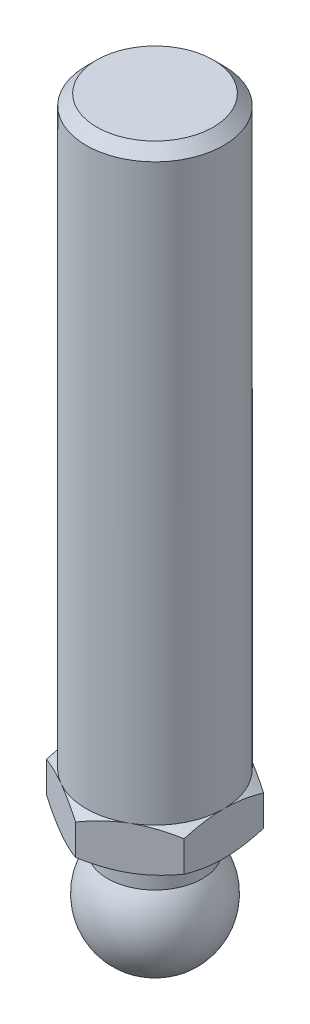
ISO-10303-21;
HEADER;
FILE_DESCRIPTION(('STEP AP214'),'2;1');
FILE_NAME('part.step','',(''),(''),'','','');
FILE_SCHEMA(('AUTOMOTIVE_DESIGN { 1 0 10303 214 1 1 1 1 }'));
ENDSEC;
DATA;
#1=APPLICATION_CONTEXT('core data for automotive mechanical design processes');
#2=APPLICATION_PROTOCOL_DEFINITION('international standard','automotive_design',2000,#1);
#3=PRODUCT_CONTEXT('',#1,'mechanical');
#4=PRODUCT('Part','Part','',(#3));
#5=PRODUCT_RELATED_PRODUCT_CATEGORY('part','',(#4));
#6=PRODUCT_DEFINITION_FORMATION('','',#4);
#7=PRODUCT_DEFINITION_CONTEXT('part definition',#1,'design');
#8=PRODUCT_DEFINITION('design','',#6,#7);
#9=PRODUCT_DEFINITION_SHAPE('','',#8);
#10=(LENGTH_UNIT() NAMED_UNIT(*) SI_UNIT(.MILLI.,.METRE.));
#11=(NAMED_UNIT(*) PLANE_ANGLE_UNIT() SI_UNIT($,.RADIAN.));
#12=(NAMED_UNIT(*) SI_UNIT($,.STERADIAN.) SOLID_ANGLE_UNIT());
#13=UNCERTAINTY_MEASURE_WITH_UNIT(LENGTH_MEASURE(1.E-05),#10,'distance_accuracy_value','');
#14=(GEOMETRIC_REPRESENTATION_CONTEXT(3) GLOBAL_UNCERTAINTY_ASSIGNED_CONTEXT((#13)) GLOBAL_UNIT_ASSIGNED_CONTEXT((#10,
#11,#12)) REPRESENTATION_CONTEXT('',''));
#15=CARTESIAN_POINT('',(0.,0.,0.));
#16=DIRECTION('',(0.,0.,1.));
#17=DIRECTION('',(1.,0.,0.));
#18=AXIS2_PLACEMENT_3D('',#15,#16,#17);
#19=CARTESIAN_POINT('',(0.,19.5,0.));
#20=DIRECTION('',(0.,-1.,0.));
#21=DIRECTION('',(0.,0.,-1.));
#22=AXIS2_PLACEMENT_3D('',#19,#20,#21);
#23=CONICAL_SURFACE('',#22,8.,1.0471975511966);
#24=CARTESIAN_POINT('',(-8.,14.714451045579,14.1889203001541));
#25=CARTESIAN_POINT('',(-8.,14.8842783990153,13.851186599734));
#26=CARTESIAN_POINT('',(-8.,15.0529801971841,13.5128811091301));
#27=CARTESIAN_POINT('',(-8.,15.3875863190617,12.8348638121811));
#28=CARTESIAN_POINT('',(-8.,15.553490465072,12.4951519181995));
#29=CARTESIAN_POINT('',(-8.,15.8822522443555,11.8134403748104));
#30=CARTESIAN_POINT('',(-8.,16.0451033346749,11.4714375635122));
#31=CARTESIAN_POINT('',(-8.,16.3666666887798,10.7854960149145));
#32=CARTESIAN_POINT('',(-8.,16.5253790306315,10.4415573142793));
#33=CARTESIAN_POINT('',(-8.,16.8449502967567,9.73535271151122));
#34=CARTESIAN_POINT('',(-8.,17.0055671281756,9.37297690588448));
#35=CARTESIAN_POINT('',(-8.,17.3197730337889,8.64516064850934));
#36=CARTESIAN_POINT('',(-8.,17.4733617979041,8.27972006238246));
#37=CARTESIAN_POINT('',(-8.,17.7714937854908,7.54540420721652));
#38=CARTESIAN_POINT('',(-8.,17.9160424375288,7.1765311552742));
#39=CARTESIAN_POINT('',(-8.,18.1936308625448,6.43449862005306));
#40=CARTESIAN_POINT('',(-8.,18.3266718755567,6.06133960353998));
#41=CARTESIAN_POINT('',(-8.,18.605819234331,5.22677195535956));
#42=CARTESIAN_POINT('',(-8.,18.7482891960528,4.76412920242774));
#43=CARTESIAN_POINT('',(-8.,19.0033463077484,3.83044032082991));
#44=CARTESIAN_POINT('',(-8.,19.115935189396,3.3593946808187));
#45=CARTESIAN_POINT('',(-8.,19.2546281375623,2.651184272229));
#46=CARTESIAN_POINT('',(-8.,19.2955954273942,2.41690742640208));
#47=CARTESIAN_POINT('',(-8.,19.3670123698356,1.94676929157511));
#48=CARTESIAN_POINT('',(-8.,19.3974635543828,1.71090823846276));
#49=CARTESIAN_POINT('',(-8.,19.4469446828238,1.23805721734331));
#50=CARTESIAN_POINT('',(-8.,19.4659782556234,1.0010676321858));
#51=CARTESIAN_POINT('',(-8.,19.4920206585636,0.526423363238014));
#52=CARTESIAN_POINT('',(-8.,19.499029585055,0.288768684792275));
#53=CARTESIAN_POINT('',(-8.,19.5007883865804,-0.188309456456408));
#54=CARTESIAN_POINT('',(-8.,19.4954490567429,-0.427733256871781));
#55=CARTESIAN_POINT('',(-8.,19.4725128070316,-0.905988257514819));
#56=CARTESIAN_POINT('',(-8.,19.4549157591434,-1.14481945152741));
#57=CARTESIAN_POINT('',(-8.,19.4080408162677,-1.62141631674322));
#58=CARTESIAN_POINT('',(-8.,19.3787584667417,-1.85918154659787));
#59=CARTESIAN_POINT('',(-8.,19.3094074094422,-2.33311174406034));
#60=CARTESIAN_POINT('',(-8.,19.2693385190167,-2.56927668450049));
#61=CARTESIAN_POINT('',(-8.,19.1329562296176,-3.28330816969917));
#62=CARTESIAN_POINT('',(-8.,19.0213579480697,-3.75830022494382));
#63=CARTESIAN_POINT('',(-8.,18.830875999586,-4.46428489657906));
#64=CARTESIAN_POINT('',(-8.,18.7635265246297,-4.69855285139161));
#65=CARTESIAN_POINT('',(-8.,18.6221775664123,-5.16507806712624));
#66=CARTESIAN_POINT('',(-8.,18.5481783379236,-5.39733540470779));
#67=CARTESIAN_POINT('',(-8.,18.3456232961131,-6.00705809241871));
#68=CARTESIAN_POINT('',(-8.,18.2123002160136,-6.38293491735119));
#69=CARTESIAN_POINT('',(-8.,17.9338794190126,-7.13030495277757));
#70=CARTESIAN_POINT('',(-8.,17.7887803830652,-7.50179766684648));
#71=CARTESIAN_POINT('',(-8.,17.4893388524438,-8.24128843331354));
#72=CARTESIAN_POINT('',(-8.,17.3349906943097,-8.60928418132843));
#73=CARTESIAN_POINT('',(-8.,17.0191219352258,-9.34215095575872));
#74=CARTESIAN_POINT('',(-8.,16.8576016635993,-9.70702212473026));
#75=CARTESIAN_POINT('',(-8.,16.5362228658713,-10.4179250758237));
#76=CARTESIAN_POINT('',(-8.,16.3766130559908,-10.7640696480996));
#77=CARTESIAN_POINT('',(-8.,16.0531867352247,-11.4543922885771));
#78=CARTESIAN_POINT('',(-8.,15.8893701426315,-11.798570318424));
#79=CARTESIAN_POINT('',(-8.,15.558638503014,-12.4845836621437));
#80=CARTESIAN_POINT('',(-8.,15.3917303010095,-12.8264222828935));
#81=CARTESIAN_POINT('',(-8.,15.0550779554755,-13.5086735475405));
#82=CARTESIAN_POINT('',(-8.,14.8853339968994,-13.8490862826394));
#83=CARTESIAN_POINT('',(-8.,14.714451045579,-14.1889203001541));
#84=B_SPLINE_CURVE_WITH_KNOTS('',3,(#24,#25,#26,#27,#28,#29,#30,#31,#32,#33,#34,#35,#36,#37,#38,
#39,#40,#41,#42,#43,#44,#45,#46,#47,#48,#49,#50,#51,#52,#53,#54,#55,#56,#57,#58,#59,#60,#61,#62,
#63,#64,#65,#66,#67,#68,#69,#70,#71,#72,#73,#74,#75,#76,#77,#78,#79,#80,#81,#82,#83),
.UNSPECIFIED.,.F.,.F.,(4,2,2,2,2,2,2,2,2,2,2,2,2,2,2,2,2,2,2,2,2,2,2,2,2,2,2,2,2,4),(0.,
1.13409047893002,2.26825272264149,3.40461779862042,4.5409614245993,5.73003075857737,
6.91915250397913,8.10755318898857,9.29582565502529,10.7473798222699,12.1988498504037,
12.9121466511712,13.6253394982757,14.3383055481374,15.0512658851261,15.7693927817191,
16.487527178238,17.2059355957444,17.9243561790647,19.38648697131,20.1177019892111,
20.8488890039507,22.0450800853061,23.2414053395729,24.4384707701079,25.6354812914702,
26.7789606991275,27.9224623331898,29.063679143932,30.2048218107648),.UNSPECIFIED.);
#85=CARTESIAN_POINT('',(-8.,18.7854688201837,4.61880215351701));
#86=VERTEX_POINT('',#85);
#87=CARTESIAN_POINT('',(-8.,19.5,0.));
#88=VERTEX_POINT('',#87);
#89=EDGE_CURVE('E313',#86,#88,#84,.T.);
#90=ORIENTED_EDGE('',*,*,#89,.F.);
#91=CARTESIAN_POINT('',(0.0002,18.7854021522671,9.23771977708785));
#92=CARTESIAN_POINT('',(-0.175648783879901,18.8440092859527,9.13619343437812));
#93=CARTESIAN_POINT('',(-0.352153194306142,18.8999565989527,9.03428856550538));
#94=CARTESIAN_POINT('',(-0.706595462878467,19.0057989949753,8.82965122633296));
#95=CARTESIAN_POINT('',(-0.884533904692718,19.0556914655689,8.72691841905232));
#96=CARTESIAN_POINT('',(-1.42119823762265,19.1953072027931,8.41707512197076));
#97=CARTESIAN_POINT('',(-1.78204258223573,19.2747188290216,8.20874154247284));
#98=CARTESIAN_POINT('',(-2.32203917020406,19.3678383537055,7.89697436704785));
#99=CARTESIAN_POINT('',(-2.49957818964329,19.3943654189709,7.79447216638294));
#100=CARTESIAN_POINT('',(-2.85545911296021,19.4388468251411,7.58900421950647));
#101=CARTESIAN_POINT('',(-3.03380094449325,19.4568019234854,7.4860385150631));
#102=CARTESIAN_POINT('',(-3.3907916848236,19.4836843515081,7.27992981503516));
#103=CARTESIAN_POINT('',(-3.56944001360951,19.4926219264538,7.17678715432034));
#104=CARTESIAN_POINT('',(-3.92690170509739,19.5012776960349,6.97040655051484));
#105=CARTESIAN_POINT('',(-4.10571506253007,19.5009961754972,6.86716861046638));
#106=CARTESIAN_POINT('',(-4.44001336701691,19.4918549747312,6.67416139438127));
#107=CARTESIAN_POINT('',(-4.59552190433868,19.4841103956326,6.58437849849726));
#108=CARTESIAN_POINT('',(-4.90617476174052,19.4617988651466,6.40502298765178));
#109=CARTESIAN_POINT('',(-5.06131905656,19.4472314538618,6.31545038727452));
#110=CARTESIAN_POINT('',(-5.52615131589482,19.3936393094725,6.04707935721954));
#111=CARTESIAN_POINT('',(-5.83501648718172,19.3447313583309,5.86875596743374));
#112=CARTESIAN_POINT('',(-6.4560232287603,19.2224605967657,5.51021755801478));
#113=CARTESIAN_POINT('',(-6.76808554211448,19.148579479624,5.33004829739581));
#114=CARTESIAN_POINT('',(-7.38755648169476,18.980899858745,4.97239658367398));
#115=CARTESIAN_POINT('',(-7.69497304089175,18.8871407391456,4.79490955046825));
#116=CARTESIAN_POINT('',(-8.0002,18.7854021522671,4.61868668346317));
#117=B_SPLINE_CURVE_WITH_KNOTS('',3,(#91,#92,#93,#94,#95,#96,#97,#98,#99,#100,#101,#102,#103,
#104,#105,#106,#107,#108,#109,#110,#111,#112,#113,#114,#115,#116),.UNSPECIFIED.,.F.,.F.,(4,2,2,
2,2,2,2,2,2,2,2,2,4),(0.,0.633973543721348,1.26821965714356,2.53934712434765,3.15934343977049,
3.77928496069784,4.39852133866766,5.01773858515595,5.55680239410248,6.09590254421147,
7.17487077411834,8.27776850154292,9.37850115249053),.UNSPECIFIED.);
#118=CARTESIAN_POINT('',(-4.,19.5,6.92820323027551));
#119=VERTEX_POINT('',#118);
#120=EDGE_CURVE('E138',#119,#86,#117,.T.);
#121=ORIENTED_EDGE('',*,*,#120,.F.);
#122=CARTESIAN_POINT('',(0.,19.5,0.));
#123=DIRECTION('',(0.,-1.,0.));
#124=DIRECTION('',(0.,0.,-1.));
#125=AXIS2_PLACEMENT_3D('',#122,#123,#124);
#126=CIRCLE('',#125,8.);
#127=EDGE_CURVE('E286',#119,#88,#126,.T.);
#128=ORIENTED_EDGE('',*,*,#127,.T.);
#129=EDGE_LOOP('',(#90,#121,#128));
#130=FACE_BOUND('',#129,.T.);
#131=ADVANCED_FACE('F17',(#130),#23,.T.);
#132=CARTESIAN_POINT('',(-8.,18.7854688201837,-4.61880215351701));
#133=VERTEX_POINT('',#132);
#134=EDGE_CURVE('E196',#88,#133,#84,.T.);
#135=ORIENTED_EDGE('',*,*,#134,.F.);
#136=CARTESIAN_POINT('',(-4.,19.5,-6.92820323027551));
#137=VERTEX_POINT('',#136);
#138=EDGE_CURVE('E198',#88,#137,#126,.T.);
#139=ORIENTED_EDGE('',*,*,#138,.T.);
#140=CARTESIAN_POINT('',(-8.0002,18.7854021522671,-4.61868668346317));
#141=CARTESIAN_POINT('',(-7.8243512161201,18.8440092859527,-4.7202130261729));
#142=CARTESIAN_POINT('',(-7.64784680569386,18.8999565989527,-4.82211789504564));
#143=CARTESIAN_POINT('',(-7.29340453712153,19.0057989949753,-5.02675523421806));
#144=CARTESIAN_POINT('',(-7.11546609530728,19.0556914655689,-5.1294880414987));
#145=CARTESIAN_POINT('',(-6.57880176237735,19.1953072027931,-5.43933133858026));
#146=CARTESIAN_POINT('',(-6.21795741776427,19.2747188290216,-5.64766491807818));
#147=CARTESIAN_POINT('',(-5.67796082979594,19.3678383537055,-5.95943209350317));
#148=CARTESIAN_POINT('',(-5.50042181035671,19.3943654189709,-6.06193429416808));
#149=CARTESIAN_POINT('',(-5.14454088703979,19.4388468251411,-6.26740224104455));
#150=CARTESIAN_POINT('',(-4.96619905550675,19.4568019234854,-6.37036794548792));
#151=CARTESIAN_POINT('',(-4.6092083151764,19.4836843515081,-6.57647664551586));
#152=CARTESIAN_POINT('',(-4.43055998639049,19.4926219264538,-6.67961930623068));
#153=CARTESIAN_POINT('',(-4.07309829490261,19.5012776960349,-6.88599991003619));
#154=CARTESIAN_POINT('',(-3.89428493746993,19.5009961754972,-6.98923785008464));
#155=CARTESIAN_POINT('',(-3.55998663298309,19.4918549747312,-7.18224506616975));
#156=CARTESIAN_POINT('',(-3.40447809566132,19.4841103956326,-7.27202796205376));
#157=CARTESIAN_POINT('',(-3.09382523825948,19.4617988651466,-7.45138347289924));
#158=CARTESIAN_POINT('',(-2.93868094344,19.4472314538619,-7.54095607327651));
#159=CARTESIAN_POINT('',(-2.47384868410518,19.3936393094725,-7.80932710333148));
#160=CARTESIAN_POINT('',(-2.16498351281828,19.3447313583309,-7.98765049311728));
#161=CARTESIAN_POINT('',(-1.5439767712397,19.2224605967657,-8.34618890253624));
#162=CARTESIAN_POINT('',(-1.23191445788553,19.148579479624,-8.52635816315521));
#163=CARTESIAN_POINT('',(-0.612443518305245,18.980899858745,-8.88400987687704));
#164=CARTESIAN_POINT('',(-0.305026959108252,18.8871407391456,-9.06149691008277));
#165=CARTESIAN_POINT('',(0.000199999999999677,18.7854021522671,-9.23771977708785));
#166=B_SPLINE_CURVE_WITH_KNOTS('',3,(#140,#141,#142,#143,#144,#145,#146,#147,#148,#149,#150,
#151,#152,#153,#154,#155,#156,#157,#158,#159,#160,#161,#162,#163,#164,#165),.UNSPECIFIED.,.F.,
.F.,(4,2,2,2,2,2,2,2,2,2,2,2,4),(0.,0.633973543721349,1.26821965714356,2.53934712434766,
3.15934343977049,3.77928496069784,4.39852133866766,5.01773858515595,5.55680239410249,
6.09590254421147,7.17487077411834,8.27776850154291,9.37850115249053),.UNSPECIFIED.);
#167=EDGE_CURVE('E186',#133,#137,#166,.T.);
#168=ORIENTED_EDGE('',*,*,#167,.F.);
#169=EDGE_LOOP('',(#135,#139,#168));
#170=FACE_BOUND('',#169,.T.);
#171=ADVANCED_FACE('F195',(#170),#23,.T.);
#172=CARTESIAN_POINT('',(0.,18.7854688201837,-9.23760430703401));
#173=VERTEX_POINT('',#172);
#174=EDGE_CURVE('E200',#137,#173,#166,.T.);
#175=ORIENTED_EDGE('',*,*,#174,.F.);
#176=CARTESIAN_POINT('',(4.,19.5,-6.92820323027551));
#177=VERTEX_POINT('',#176);
#178=EDGE_CURVE('E293',#137,#177,#126,.T.);
#179=ORIENTED_EDGE('',*,*,#178,.T.);
#180=CARTESIAN_POINT('',(-0.0002,18.7854021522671,-9.23771977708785));
#181=CARTESIAN_POINT('',(0.175648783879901,18.8440092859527,-9.13619343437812));
#182=CARTESIAN_POINT('',(0.352153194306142,18.8999565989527,-9.03428856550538));
#183=CARTESIAN_POINT('',(0.706595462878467,19.0057989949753,-8.82965122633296));
#184=CARTESIAN_POINT('',(0.884533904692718,19.0556914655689,-8.72691841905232));
#185=CARTESIAN_POINT('',(1.42119823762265,19.1953072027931,-8.41707512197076));
#186=CARTESIAN_POINT('',(1.78204258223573,19.2747188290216,-8.20874154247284));
#187=CARTESIAN_POINT('',(2.32203917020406,19.3678383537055,-7.89697436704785));
#188=CARTESIAN_POINT('',(2.49957818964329,19.3943654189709,-7.79447216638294));
#189=CARTESIAN_POINT('',(2.85545911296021,19.4388468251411,-7.58900421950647));
#190=CARTESIAN_POINT('',(3.03380094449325,19.4568019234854,-7.4860385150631));
#191=CARTESIAN_POINT('',(3.3907916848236,19.4836843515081,-7.27992981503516));
#192=CARTESIAN_POINT('',(3.56944001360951,19.4926219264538,-7.17678715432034));
#193=CARTESIAN_POINT('',(3.92690170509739,19.5012776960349,-6.97040655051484));
#194=CARTESIAN_POINT('',(4.10571506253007,19.5009961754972,-6.86716861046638));
#195=CARTESIAN_POINT('',(4.44001336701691,19.4918549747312,-6.67416139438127));
#196=CARTESIAN_POINT('',(4.59552190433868,19.4841103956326,-6.58437849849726));
#197=CARTESIAN_POINT('',(4.90617476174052,19.4617988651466,-6.40502298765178));
#198=CARTESIAN_POINT('',(5.06131905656,19.4472314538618,-6.31545038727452));
#199=CARTESIAN_POINT('',(5.52615131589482,19.3936393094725,-6.04707935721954));
#200=CARTESIAN_POINT('',(5.83501648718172,19.3447313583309,-5.86875596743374));
#201=CARTESIAN_POINT('',(6.4560232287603,19.2224605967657,-5.51021755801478));
#202=CARTESIAN_POINT('',(6.76808554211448,19.148579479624,-5.33004829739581));
#203=CARTESIAN_POINT('',(7.38755648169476,18.980899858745,-4.97239658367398));
#204=CARTESIAN_POINT('',(7.69497304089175,18.8871407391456,-4.79490955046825));
#205=CARTESIAN_POINT('',(8.0002,18.7854021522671,-4.61868668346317));
#206=B_SPLINE_CURVE_WITH_KNOTS('',3,(#180,#181,#182,#183,#184,#185,#186,#187,#188,#189,#190,
#191,#192,#193,#194,#195,#196,#197,#198,#199,#200,#201,#202,#203,#204,#205),.UNSPECIFIED.,.F.,
.F.,(4,2,2,2,2,2,2,2,2,2,2,2,4),(0.,0.633973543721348,1.26821965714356,2.53934712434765,
3.15934343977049,3.77928496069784,4.39852133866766,5.01773858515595,5.55680239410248,
6.09590254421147,7.17487077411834,8.27776850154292,9.37850115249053),.UNSPECIFIED.);
#207=EDGE_CURVE('E246',#173,#177,#206,.T.);
#208=ORIENTED_EDGE('',*,*,#207,.F.);
#209=EDGE_LOOP('',(#175,#179,#208));
#210=FACE_BOUND('',#209,.T.);
#211=ADVANCED_FACE('F345',(#210),#23,.T.);
#212=CARTESIAN_POINT('',(8.,18.7854688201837,-4.61880215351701));
#213=VERTEX_POINT('',#212);
#214=EDGE_CURVE('E241',#177,#213,#206,.T.);
#215=ORIENTED_EDGE('',*,*,#214,.F.);
#216=CARTESIAN_POINT('',(8.,19.5,0.));
#217=VERTEX_POINT('',#216);
#218=EDGE_CURVE('E290',#177,#217,#126,.T.);
#219=ORIENTED_EDGE('',*,*,#218,.T.);
#220=CARTESIAN_POINT('',(8.,14.714451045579,-14.1889203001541));
#221=CARTESIAN_POINT('',(8.,14.8842783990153,-13.851186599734));
#222=CARTESIAN_POINT('',(8.,15.0529801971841,-13.5128811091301));
#223=CARTESIAN_POINT('',(8.,15.3875863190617,-12.8348638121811));
#224=CARTESIAN_POINT('',(8.,15.553490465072,-12.4951519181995));
#225=CARTESIAN_POINT('',(8.,15.8822522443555,-11.8134403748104));
#226=CARTESIAN_POINT('',(8.,16.0451033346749,-11.4714375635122));
#227=CARTESIAN_POINT('',(8.,16.3666666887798,-10.7854960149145));
#228=CARTESIAN_POINT('',(8.,16.5253790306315,-10.4415573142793));
#229=CARTESIAN_POINT('',(8.,16.8449502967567,-9.73535271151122));
#230=CARTESIAN_POINT('',(8.,17.0055671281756,-9.37297690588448));
#231=CARTESIAN_POINT('',(8.,17.3197730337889,-8.64516064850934));
#232=CARTESIAN_POINT('',(8.,17.4733617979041,-8.27972006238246));
#233=CARTESIAN_POINT('',(8.,17.7714937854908,-7.54540420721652));
#234=CARTESIAN_POINT('',(8.,17.9160424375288,-7.1765311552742));
#235=CARTESIAN_POINT('',(8.,18.1936308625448,-6.43449862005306));
#236=CARTESIAN_POINT('',(8.,18.3266718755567,-6.06133960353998));
#237=CARTESIAN_POINT('',(8.,18.605819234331,-5.22677195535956));
#238=CARTESIAN_POINT('',(8.,18.7482891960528,-4.76412920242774));
#239=CARTESIAN_POINT('',(8.,19.0033463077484,-3.83044032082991));
#240=CARTESIAN_POINT('',(8.,19.115935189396,-3.3593946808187));
#241=CARTESIAN_POINT('',(8.,19.2546281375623,-2.651184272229));
#242=CARTESIAN_POINT('',(8.,19.2955954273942,-2.41690742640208));
#243=CARTESIAN_POINT('',(8.,19.3670123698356,-1.94676929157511));
#244=CARTESIAN_POINT('',(8.,19.3974635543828,-1.71090823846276));
#245=CARTESIAN_POINT('',(8.,19.4469446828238,-1.23805721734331));
#246=CARTESIAN_POINT('',(8.,19.4659782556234,-1.0010676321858));
#247=CARTESIAN_POINT('',(8.,19.4920206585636,-0.526423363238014));
#248=CARTESIAN_POINT('',(8.,19.499029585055,-0.288768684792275));
#249=CARTESIAN_POINT('',(8.,19.5007883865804,0.188309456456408));
#250=CARTESIAN_POINT('',(8.,19.4954490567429,0.427733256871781));
#251=CARTESIAN_POINT('',(8.,19.4725128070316,0.905988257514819));
#252=CARTESIAN_POINT('',(8.,19.4549157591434,1.14481945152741));
#253=CARTESIAN_POINT('',(8.,19.4080408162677,1.62141631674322));
#254=CARTESIAN_POINT('',(8.,19.3787584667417,1.85918154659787));
#255=CARTESIAN_POINT('',(8.,19.3094074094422,2.33311174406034));
#256=CARTESIAN_POINT('',(8.,19.2693385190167,2.56927668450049));
#257=CARTESIAN_POINT('',(8.,19.1329562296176,3.28330816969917));
#258=CARTESIAN_POINT('',(8.,19.0213579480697,3.75830022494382));
#259=CARTESIAN_POINT('',(8.,18.830875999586,4.46428489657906));
#260=CARTESIAN_POINT('',(8.,18.7635265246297,4.69855285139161));
#261=CARTESIAN_POINT('',(8.,18.6221775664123,5.16507806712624));
#262=CARTESIAN_POINT('',(8.,18.5481783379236,5.39733540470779));
#263=CARTESIAN_POINT('',(8.,18.3456232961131,6.00705809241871));
#264=CARTESIAN_POINT('',(8.,18.2123002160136,6.38293491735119));
#265=CARTESIAN_POINT('',(8.,17.9338794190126,7.13030495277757));
#266=CARTESIAN_POINT('',(8.,17.7887803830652,7.50179766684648));
#267=CARTESIAN_POINT('',(8.,17.4893388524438,8.24128843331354));
#268=CARTESIAN_POINT('',(8.,17.3349906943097,8.60928418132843));
#269=CARTESIAN_POINT('',(8.,17.0191219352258,9.34215095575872));
#270=CARTESIAN_POINT('',(8.,16.8576016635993,9.70702212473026));
#271=CARTESIAN_POINT('',(8.,16.5362228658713,10.4179250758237));
#272=CARTESIAN_POINT('',(8.,16.3766130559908,10.7640696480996));
#273=CARTESIAN_POINT('',(8.,16.0531867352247,11.4543922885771));
#274=CARTESIAN_POINT('',(8.,15.8893701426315,11.798570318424));
#275=CARTESIAN_POINT('',(8.,15.558638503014,12.4845836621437));
#276=CARTESIAN_POINT('',(8.,15.3917303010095,12.8264222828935));
#277=CARTESIAN_POINT('',(8.,15.0550779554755,13.5086735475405));
#278=CARTESIAN_POINT('',(8.,14.8853339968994,13.8490862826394));
#279=CARTESIAN_POINT('',(8.,14.714451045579,14.1889203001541));
#280=B_SPLINE_CURVE_WITH_KNOTS('',3,(#220,#221,#222,#223,#224,#225,#226,#227,#228,#229,#230,
#231,#232,#233,#234,#235,#236,#237,#238,#239,#240,#241,#242,#243,#244,#245,#246,#247,#248,#249,
#250,#251,#252,#253,#254,#255,#256,#257,#258,#259,#260,#261,#262,#263,#264,#265,#266,#267,#268,
#269,#270,#271,#272,#273,#274,#275,#276,#277,#278,#279),.UNSPECIFIED.,.F.,.F.,(4,2,2,2,2,2,2,2,
2,2,2,2,2,2,2,2,2,2,2,2,2,2,2,2,2,2,2,2,2,4),(0.,1.13409047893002,2.26825272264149,
3.40461779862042,4.5409614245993,5.73003075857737,6.91915250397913,8.10755318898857,
9.29582565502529,10.7473798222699,12.1988498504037,12.9121466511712,13.6253394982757,
14.3383055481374,15.0512658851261,15.7693927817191,16.487527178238,17.2059355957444,
17.9243561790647,19.38648697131,20.1177019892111,20.8488890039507,22.0450800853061,
23.2414053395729,24.4384707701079,25.6354812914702,26.7789606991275,27.9224623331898,
29.063679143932,30.2048218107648),.UNSPECIFIED.);
#281=EDGE_CURVE('E252',#213,#217,#280,.T.);
#282=ORIENTED_EDGE('',*,*,#281,.F.);
#283=EDGE_LOOP('',(#215,#219,#282));
#284=FACE_BOUND('',#283,.T.);
#285=ADVANCED_FACE('F355',(#284),#23,.T.);
#286=CARTESIAN_POINT('',(8.,18.7854688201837,4.61880215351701));
#287=VERTEX_POINT('',#286);
#288=EDGE_CURVE('E254',#217,#287,#280,.T.);
#289=ORIENTED_EDGE('',*,*,#288,.F.);
#290=CARTESIAN_POINT('',(4.,19.5,6.92820323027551));
#291=VERTEX_POINT('',#290);
#292=EDGE_CURVE('E284',#217,#291,#126,.T.);
#293=ORIENTED_EDGE('',*,*,#292,.T.);
#294=CARTESIAN_POINT('',(8.0002,18.7854021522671,4.61868668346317));
#295=CARTESIAN_POINT('',(7.8243512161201,18.8440092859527,4.7202130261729));
#296=CARTESIAN_POINT('',(7.64784680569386,18.8999565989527,4.82211789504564));
#297=CARTESIAN_POINT('',(7.29340453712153,19.0057989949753,5.02675523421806));
#298=CARTESIAN_POINT('',(7.11546609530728,19.0556914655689,5.1294880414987));
#299=CARTESIAN_POINT('',(6.57880176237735,19.1953072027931,5.43933133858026));
#300=CARTESIAN_POINT('',(6.21795741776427,19.2747188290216,5.64766491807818));
#301=CARTESIAN_POINT('',(5.67796082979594,19.3678383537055,5.95943209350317));
#302=CARTESIAN_POINT('',(5.50042181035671,19.3943654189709,6.06193429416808));
#303=CARTESIAN_POINT('',(5.14454088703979,19.4388468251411,6.26740224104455));
#304=CARTESIAN_POINT('',(4.96619905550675,19.4568019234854,6.37036794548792));
#305=CARTESIAN_POINT('',(4.6092083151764,19.4836843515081,6.57647664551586));
#306=CARTESIAN_POINT('',(4.43055998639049,19.4926219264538,6.67961930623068));
#307=CARTESIAN_POINT('',(4.07309829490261,19.5012776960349,6.88599991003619));
#308=CARTESIAN_POINT('',(3.89428493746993,19.5009961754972,6.98923785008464));
#309=CARTESIAN_POINT('',(3.55998663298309,19.4918549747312,7.18224506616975));
#310=CARTESIAN_POINT('',(3.40447809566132,19.4841103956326,7.27202796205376));
#311=CARTESIAN_POINT('',(3.09382523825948,19.4617988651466,7.45138347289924));
#312=CARTESIAN_POINT('',(2.93868094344,19.4472314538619,7.54095607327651));
#313=CARTESIAN_POINT('',(2.47384868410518,19.3936393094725,7.80932710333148));
#314=CARTESIAN_POINT('',(2.16498351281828,19.3447313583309,7.98765049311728));
#315=CARTESIAN_POINT('',(1.5439767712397,19.2224605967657,8.34618890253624));
#316=CARTESIAN_POINT('',(1.23191445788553,19.148579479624,8.52635816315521));
#317=CARTESIAN_POINT('',(0.612443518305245,18.980899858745,8.88400987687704));
#318=CARTESIAN_POINT('',(0.305026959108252,18.8871407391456,9.06149691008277));
#319=CARTESIAN_POINT('',(-0.000199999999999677,18.7854021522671,9.23771977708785));
#320=B_SPLINE_CURVE_WITH_KNOTS('',3,(#294,#295,#296,#297,#298,#299,#300,#301,#302,#303,#304,
#305,#306,#307,#308,#309,#310,#311,#312,#313,#314,#315,#316,#317,#318,#319),.UNSPECIFIED.,.F.,
.F.,(4,2,2,2,2,2,2,2,2,2,2,2,4),(0.,0.633973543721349,1.26821965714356,2.53934712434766,
3.15934343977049,3.77928496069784,4.39852133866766,5.01773858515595,5.55680239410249,
6.09590254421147,7.17487077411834,8.27776850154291,9.37850115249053),.UNSPECIFIED.);
#321=EDGE_CURVE('E129',#287,#291,#320,.T.);
#322=ORIENTED_EDGE('',*,*,#321,.F.);
#323=EDGE_LOOP('',(#289,#293,#322));
#324=FACE_BOUND('',#323,.T.);
#325=ADVANCED_FACE('F288',(#324),#23,.T.);
#326=CARTESIAN_POINT('',(0.,18.7854688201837,9.23760430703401));
#327=VERTEX_POINT('',#326);
#328=EDGE_CURVE('E119',#291,#327,#320,.T.);
#329=ORIENTED_EDGE('',*,*,#328,.F.);
#330=EDGE_CURVE('E277',#291,#119,#126,.T.);
#331=ORIENTED_EDGE('',*,*,#330,.T.);
#332=EDGE_CURVE('E32',#327,#119,#117,.T.);
#333=ORIENTED_EDGE('',*,*,#332,.F.);
#334=EDGE_LOOP('',(#329,#331,#333));
#335=FACE_BOUND('',#334,.T.);
#336=ADVANCED_FACE('F276',(#335),#23,.T.);
#337=CARTESIAN_POINT('',(0.,87.5,0.));
#338=DIRECTION('',(0.,-1.,0.));
#339=DIRECTION('',(0.,0.,-1.));
#340=AXIS2_PLACEMENT_3D('',#337,#338,#339);
#341=PLANE('',#340);
#342=CARTESIAN_POINT('',(0.,87.5,0.));
#343=DIRECTION('',(0.,-1.,0.));
#344=DIRECTION('',(0.,0.,-1.));
#345=AXIS2_PLACEMENT_3D('',#342,#343,#344);
#346=CIRCLE('',#345,6.773);
#347=CARTESIAN_POINT('',(0.,87.5,-6.773));
#348=VERTEX_POINT('',#347);
#349=EDGE_CURVE('E11',#348,#348,#346,.T.);
#350=ORIENTED_EDGE('',*,*,#349,.F.);
#351=EDGE_LOOP('',(#350));
#352=FACE_BOUND('',#351,.T.);
#353=ADVANCED_FACE('F19',(#352),#341,.F.);
#354=CARTESIAN_POINT('',(0.,87.5,0.));
#355=DIRECTION('',(0.,-1.,0.));
#356=DIRECTION('',(0.,0.,-1.));
#357=AXIS2_PLACEMENT_3D('',#354,#355,#356);
#358=CONICAL_SURFACE('',#357,6.773,0.785398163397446);
#359=CARTESIAN_POINT('',(0.,86.273,0.));
#360=DIRECTION('',(0.,-1.,0.));
#361=DIRECTION('',(0.,0.,-1.));
#362=AXIS2_PLACEMENT_3D('',#359,#360,#361);
#363=CIRCLE('',#362,8.);
#364=CARTESIAN_POINT('',(0.,86.273,-8.));
#365=VERTEX_POINT('',#364);
#366=EDGE_CURVE('E25',#365,#365,#363,.T.);
#367=ORIENTED_EDGE('',*,*,#366,.F.);
#368=EDGE_LOOP('',(#367));
#369=FACE_BOUND('',#368,.T.);
#370=ORIENTED_EDGE('',*,*,#349,.T.);
#371=EDGE_LOOP('',(#370));
#372=FACE_BOUND('',#371,.T.);
#373=ADVANCED_FACE('F353',(#369,#372),#358,.T.);
#374=CARTESIAN_POINT('',(0.,0.,0.));
#375=DIRECTION('',(0.,-1.,0.));
#376=DIRECTION('',(0.,0.,-1.));
#377=AXIS2_PLACEMENT_3D('',#374,#375,#376);
#378=CYLINDRICAL_SURFACE('',#377,8.);
#379=ORIENTED_EDGE('',*,*,#292,.F.);
#380=ORIENTED_EDGE('',*,*,#218,.F.);
#381=ORIENTED_EDGE('',*,*,#178,.F.);
#382=ORIENTED_EDGE('',*,*,#138,.F.);
#383=ORIENTED_EDGE('',*,*,#127,.F.);
#384=ORIENTED_EDGE('',*,*,#330,.F.);
#385=EDGE_LOOP('',(#379,#380,#381,#382,#383,#384));
#386=FACE_BOUND('',#385,.T.);
#387=ORIENTED_EDGE('',*,*,#366,.T.);
#388=EDGE_LOOP('',(#387));
#389=FACE_BOUND('',#388,.T.);
#390=ADVANCED_FACE('F281',(#386,#389),#378,.T.);
#391=CARTESIAN_POINT('',(-8.,14.3,-4.61880215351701));
#392=DIRECTION('',(-1.,0.,0.));
#393=DIRECTION('',(0.,0.,1.));
#394=AXIS2_PLACEMENT_3D('',#391,#392,#393);
#395=PLANE('',#394);
#396=ORIENTED_EDGE('',*,*,#89,.T.);
#397=ORIENTED_EDGE('',*,*,#134,.T.);
#398=DIRECTION('',(0.,1.,0.));
#399=VECTOR('',#398,1.);
#400=CARTESIAN_POINT('',(-8.,14.3,-4.61880215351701));
#401=LINE('',#400,#399);
#402=CARTESIAN_POINT('',(-8.,15.2145311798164,-4.61880215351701));
#403=VERTEX_POINT('',#402);
#404=EDGE_CURVE('E112',#403,#133,#401,.T.);
#405=ORIENTED_EDGE('',*,*,#404,.F.);
#406=CARTESIAN_POINT('',(-8.,19.285548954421,-14.1889203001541));
#407=CARTESIAN_POINT('',(-8.,19.1157216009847,-13.851186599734));
#408=CARTESIAN_POINT('',(-8.,18.9470198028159,-13.5128811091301));
#409=CARTESIAN_POINT('',(-8.,18.6124136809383,-12.8348638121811));
#410=CARTESIAN_POINT('',(-8.,18.446509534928,-12.4951519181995));
#411=CARTESIAN_POINT('',(-8.,18.1177477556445,-11.8134403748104));
#412=CARTESIAN_POINT('',(-8.,17.9548966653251,-11.4714375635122));
#413=CARTESIAN_POINT('',(-8.,17.6333333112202,-10.7854960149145));
#414=CARTESIAN_POINT('',(-8.,17.4746209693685,-10.4415573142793));
#415=CARTESIAN_POINT('',(-8.,17.1550497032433,-9.7353527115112));
#416=CARTESIAN_POINT('',(-8.,16.9944328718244,-9.37297690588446));
#417=CARTESIAN_POINT('',(-8.,16.680226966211,-8.64516064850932));
#418=CARTESIAN_POINT('',(-8.,16.5266382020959,-8.27972006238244));
#419=CARTESIAN_POINT('',(-8.,16.2285062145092,-7.54540420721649));
#420=CARTESIAN_POINT('',(-8.,16.0839575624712,-7.17653115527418));
#421=CARTESIAN_POINT('',(-8.,15.8063691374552,-6.43449862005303));
#422=CARTESIAN_POINT('',(-8.,15.6733281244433,-6.06133960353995));
#423=CARTESIAN_POINT('',(-8.,15.394180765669,-5.22677195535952));
#424=CARTESIAN_POINT('',(-8.,15.2517108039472,-4.7641292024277));
#425=CARTESIAN_POINT('',(-8.,14.9966536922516,-3.83044032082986));
#426=CARTESIAN_POINT('',(-8.,14.884064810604,-3.35939468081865));
#427=CARTESIAN_POINT('',(-8.,14.7453718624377,-2.65118427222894));
#428=CARTESIAN_POINT('',(-8.,14.7044045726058,-2.41690742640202));
#429=CARTESIAN_POINT('',(-8.,14.6329876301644,-1.94676929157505));
#430=CARTESIAN_POINT('',(-8.,14.6025364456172,-1.7109082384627));
#431=CARTESIAN_POINT('',(-8.,14.5530553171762,-1.23805721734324));
#432=CARTESIAN_POINT('',(-8.,14.5340217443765,-1.00106763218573));
#433=CARTESIAN_POINT('',(-8.,14.5079793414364,-0.52642336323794));
#434=CARTESIAN_POINT('',(-8.,14.500970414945,-0.288768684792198));
#435=CARTESIAN_POINT('',(-8.,14.4992116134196,0.188309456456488));
#436=CARTESIAN_POINT('',(-8.,14.5045509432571,0.427733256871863));
#437=CARTESIAN_POINT('',(-8.,14.5274871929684,0.905988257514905));
#438=CARTESIAN_POINT('',(-8.,14.5450842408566,1.1448194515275));
#439=CARTESIAN_POINT('',(-8.,14.5919591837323,1.62141631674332));
#440=CARTESIAN_POINT('',(-8.,14.6212415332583,1.85918154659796));
#441=CARTESIAN_POINT('',(-8.,14.6905925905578,2.33311174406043));
#442=CARTESIAN_POINT('',(-8.,14.7306614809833,2.56927668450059));
#443=CARTESIAN_POINT('',(-8.,14.8670437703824,3.28330816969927));
#444=CARTESIAN_POINT('',(-8.,14.9786420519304,3.75830022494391));
#445=CARTESIAN_POINT('',(-8.,15.169124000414,4.46428489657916));
#446=CARTESIAN_POINT('',(-8.,15.2364734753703,4.69855285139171));
#447=CARTESIAN_POINT('',(-8.,15.3778224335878,5.16507806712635));
#448=CARTESIAN_POINT('',(-8.,15.4518216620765,5.3973354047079));
#449=CARTESIAN_POINT('',(-8.,15.654376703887,6.0070580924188));
#450=CARTESIAN_POINT('',(-8.,15.7876997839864,6.38293491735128));
#451=CARTESIAN_POINT('',(-8.,16.0661205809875,7.13030495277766));
#452=CARTESIAN_POINT('',(-8.,16.2112196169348,7.50179766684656));
#453=CARTESIAN_POINT('',(-8.,16.5106611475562,8.2412884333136));
#454=CARTESIAN_POINT('',(-8.,16.6650093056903,8.60928418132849));
#455=CARTESIAN_POINT('',(-8.,16.9808780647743,9.34215095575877));
#456=CARTESIAN_POINT('',(-8.,17.1423983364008,9.7070221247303));
#457=CARTESIAN_POINT('',(-8.,17.4637771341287,10.4179250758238));
#458=CARTESIAN_POINT('',(-8.,17.6233869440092,10.7640696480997));
#459=CARTESIAN_POINT('',(-8.,17.9468132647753,11.4543922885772));
#460=CARTESIAN_POINT('',(-8.,18.1106298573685,11.7985703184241));
#461=CARTESIAN_POINT('',(-8.,18.441361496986,12.4845836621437));
#462=CARTESIAN_POINT('',(-8.,18.6082696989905,12.8264222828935));
#463=CARTESIAN_POINT('',(-8.,18.9449220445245,13.5086735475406));
#464=CARTESIAN_POINT('',(-8.,19.1146660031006,13.8490862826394));
#465=CARTESIAN_POINT('',(-8.,19.285548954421,14.1889203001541));
#466=B_SPLINE_CURVE_WITH_KNOTS('',3,(#406,#407,#408,#409,#410,#411,#412,#413,#414,#415,#416,
#417,#418,#419,#420,#421,#422,#423,#424,#425,#426,#427,#428,#429,#430,#431,#432,#433,#434,#435,
#436,#437,#438,#439,#440,#441,#442,#443,#444,#445,#446,#447,#448,#449,#450,#451,#452,#453,#454,
#455,#456,#457,#458,#459,#460,#461,#462,#463,#464,#465),.UNSPECIFIED.,.F.,.F.,(4,2,2,2,2,2,2,2,
2,2,2,2,2,2,2,2,2,2,2,2,2,2,2,2,2,2,2,2,2,4),(0.,1.13409047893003,2.2682527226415,
3.40461779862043,4.54096142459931,5.7300307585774,6.91915250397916,8.1075531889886,
9.29582565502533,10.7473798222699,12.1988498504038,12.9121466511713,13.6253394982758,
14.3383055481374,15.0512658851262,15.7693927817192,16.4875271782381,17.2059355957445,
17.9243561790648,19.3864869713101,20.1177019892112,20.8488890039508,22.0450800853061,
23.2414053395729,24.4384707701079,25.6354812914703,26.7789606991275,27.9224623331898,
29.063679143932,30.2048218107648),.UNSPECIFIED.);
#467=CARTESIAN_POINT('',(-8.,14.5,0.));
#468=VERTEX_POINT('',#467);
#469=EDGE_CURVE('E202',#403,#468,#466,.T.);
#470=ORIENTED_EDGE('',*,*,#469,.T.);
#471=CARTESIAN_POINT('',(-8.,15.2145311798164,4.61880215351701));
#472=VERTEX_POINT('',#471);
#473=EDGE_CURVE('E199',#468,#472,#466,.T.);
#474=ORIENTED_EDGE('',*,*,#473,.T.);
#475=DIRECTION('',(0.,1.,0.));
#476=VECTOR('',#475,1.);
#477=CARTESIAN_POINT('',(-8.,14.3,4.61880215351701));
#478=LINE('',#477,#476);
#479=EDGE_CURVE('E121',#472,#86,#478,.T.);
#480=ORIENTED_EDGE('',*,*,#479,.T.);
#481=EDGE_LOOP('',(#396,#397,#405,#470,#474,#480));
#482=FACE_BOUND('',#481,.T.);
#483=ADVANCED_FACE('F227',(#482),#395,.T.);
#484=CARTESIAN_POINT('',(0.,14.3,-9.23760430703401));
#485=DIRECTION('',(-0.5,0.,-0.866025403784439));
#486=DIRECTION('',(-0.866025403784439,0.,0.5));
#487=AXIS2_PLACEMENT_3D('',#484,#485,#486);
#488=PLANE('',#487);
#489=ORIENTED_EDGE('',*,*,#167,.T.);
#490=ORIENTED_EDGE('',*,*,#174,.T.);
#491=DIRECTION('',(0.,1.,0.));
#492=VECTOR('',#491,1.);
#493=CARTESIAN_POINT('',(0.,14.3,-9.23760430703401));
#494=LINE('',#493,#492);
#495=CARTESIAN_POINT('',(0.,15.2145311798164,-9.23760430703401));
#496=VERTEX_POINT('',#495);
#497=EDGE_CURVE('E178',#496,#173,#494,.T.);
#498=ORIENTED_EDGE('',*,*,#497,.F.);
#499=CARTESIAN_POINT('',(0.0002,15.214597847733,-9.23771977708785));
#500=CARTESIAN_POINT('',(-0.175648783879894,15.1559907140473,-9.13619343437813));
#501=CARTESIAN_POINT('',(-0.352153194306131,15.1000434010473,-9.03428856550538));
#502=CARTESIAN_POINT('',(-0.706595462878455,14.9942010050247,-8.82965122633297));
#503=CARTESIAN_POINT('',(-0.884533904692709,14.9443085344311,-8.72691841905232));
#504=CARTESIAN_POINT('',(-1.42119823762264,14.8046927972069,-8.41707512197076));
#505=CARTESIAN_POINT('',(-1.78204258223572,14.7252811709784,-8.20874154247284));
#506=CARTESIAN_POINT('',(-2.32203917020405,14.6321616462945,-7.89697436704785));
#507=CARTESIAN_POINT('',(-2.49957818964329,14.6056345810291,-7.79447216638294));
#508=CARTESIAN_POINT('',(-2.8554591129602,14.5611531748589,-7.58900421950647));
#509=CARTESIAN_POINT('',(-3.03380094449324,14.5431980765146,-7.4860385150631));
#510=CARTESIAN_POINT('',(-3.39079168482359,14.5163156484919,-7.27992981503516));
#511=CARTESIAN_POINT('',(-3.5694400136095,14.5073780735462,-7.17678715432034));
#512=CARTESIAN_POINT('',(-3.92690170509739,14.4987223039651,-6.97040655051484));
#513=CARTESIAN_POINT('',(-4.10571506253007,14.4990038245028,-6.86716861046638));
#514=CARTESIAN_POINT('',(-4.44001336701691,14.5081450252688,-6.67416139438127));
#515=CARTESIAN_POINT('',(-4.59552190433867,14.5158896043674,-6.58437849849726));
#516=CARTESIAN_POINT('',(-4.90617476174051,14.5382011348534,-6.40502298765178));
#517=CARTESIAN_POINT('',(-5.06131905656,14.5527685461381,-6.31545038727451));
#518=CARTESIAN_POINT('',(-5.52615131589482,14.6063606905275,-6.04707935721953));
#519=CARTESIAN_POINT('',(-5.83501648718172,14.6552686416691,-5.86875596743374));
#520=CARTESIAN_POINT('',(-6.4560232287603,14.7775394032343,-5.51021755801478));
#521=CARTESIAN_POINT('',(-6.76808554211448,14.851420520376,-5.3300482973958));
#522=CARTESIAN_POINT('',(-7.38755648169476,15.019100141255,-4.97239658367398));
#523=CARTESIAN_POINT('',(-7.69497304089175,15.1128592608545,-4.79490955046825));
#524=CARTESIAN_POINT('',(-8.0002,15.214597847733,-4.61868668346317));
#525=B_SPLINE_CURVE_WITH_KNOTS('',3,(#499,#500,#501,#502,#503,#504,#505,#506,#507,#508,#509,
#510,#511,#512,#513,#514,#515,#516,#517,#518,#519,#520,#521,#522,#523,#524),.UNSPECIFIED.,.F.,
.F.,(4,2,2,2,2,2,2,2,2,2,2,2,4),(0.,0.633973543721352,1.26821965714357,2.53934712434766,
3.1593434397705,3.77928496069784,4.39852133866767,5.01773858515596,5.5568023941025,
6.09590254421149,7.17487077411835,8.27776850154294,9.37850115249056),.UNSPECIFIED.);
#526=CARTESIAN_POINT('',(-4.,14.5,-6.92820323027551));
#527=VERTEX_POINT('',#526);
#528=EDGE_CURVE('E204',#496,#527,#525,.T.);
#529=ORIENTED_EDGE('',*,*,#528,.T.);
#530=EDGE_CURVE('E189',#527,#403,#525,.T.);
#531=ORIENTED_EDGE('',*,*,#530,.T.);
#532=ORIENTED_EDGE('',*,*,#404,.T.);
#533=EDGE_LOOP('',(#489,#490,#498,#529,#531,#532));
#534=FACE_BOUND('',#533,.T.);
#535=ADVANCED_FACE('F185',(#534),#488,.T.);
#536=CARTESIAN_POINT('',(8.,14.3,-4.61880215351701));
#537=DIRECTION('',(0.5,0.,-0.866025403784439));
#538=DIRECTION('',(-0.866025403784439,0.,-0.5));
#539=AXIS2_PLACEMENT_3D('',#536,#537,#538);
#540=PLANE('',#539);
#541=ORIENTED_EDGE('',*,*,#207,.T.);
#542=ORIENTED_EDGE('',*,*,#214,.T.);
#543=DIRECTION('',(0.,1.,0.));
#544=VECTOR('',#543,1.);
#545=CARTESIAN_POINT('',(8.,14.3,-4.61880215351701));
#546=LINE('',#545,#544);
#547=CARTESIAN_POINT('',(8.,15.2145311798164,-4.61880215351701));
#548=VERTEX_POINT('',#547);
#549=EDGE_CURVE('E175',#548,#213,#546,.T.);
#550=ORIENTED_EDGE('',*,*,#549,.F.);
#551=CARTESIAN_POINT('',(8.0002,15.214597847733,-4.61868668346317));
#552=CARTESIAN_POINT('',(7.82435121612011,15.1559907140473,-4.7202130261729));
#553=CARTESIAN_POINT('',(7.64784680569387,15.1000434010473,-4.82211789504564));
#554=CARTESIAN_POINT('',(7.29340453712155,14.9942010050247,-5.02675523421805));
#555=CARTESIAN_POINT('',(7.11546609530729,14.9443085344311,-5.1294880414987));
#556=CARTESIAN_POINT('',(6.57880176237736,14.8046927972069,-5.43933133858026));
#557=CARTESIAN_POINT('',(6.21795741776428,14.7252811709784,-5.64766491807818));
#558=CARTESIAN_POINT('',(5.67796082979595,14.6321616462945,-5.95943209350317));
#559=CARTESIAN_POINT('',(5.50042181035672,14.6056345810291,-6.06193429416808));
#560=CARTESIAN_POINT('',(5.1445408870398,14.5611531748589,-6.26740224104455));
#561=CARTESIAN_POINT('',(4.96619905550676,14.5431980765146,-6.37036794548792));
#562=CARTESIAN_POINT('',(4.60920831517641,14.5163156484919,-6.57647664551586));
#563=CARTESIAN_POINT('',(4.4305599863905,14.5073780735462,-6.67961930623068));
#564=CARTESIAN_POINT('',(4.07309829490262,14.4987223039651,-6.88599991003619));
#565=CARTESIAN_POINT('',(3.89428493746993,14.4990038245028,-6.98923785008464));
#566=CARTESIAN_POINT('',(3.55998663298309,14.5081450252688,-7.18224506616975));
#567=CARTESIAN_POINT('',(3.40447809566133,14.5158896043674,-7.27202796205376));
#568=CARTESIAN_POINT('',(3.09382523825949,14.5382011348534,-7.45138347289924));
#569=CARTESIAN_POINT('',(2.93868094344,14.5527685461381,-7.54095607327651));
#570=CARTESIAN_POINT('',(2.47384868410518,14.6063606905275,-7.80932710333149));
#571=CARTESIAN_POINT('',(2.16498351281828,14.6552686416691,-7.98765049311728));
#572=CARTESIAN_POINT('',(1.5439767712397,14.7775394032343,-8.34618890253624));
#573=CARTESIAN_POINT('',(1.23191445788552,14.851420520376,-8.52635816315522));
#574=CARTESIAN_POINT('',(0.612443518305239,15.019100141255,-8.88400987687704));
#575=CARTESIAN_POINT('',(0.305026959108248,15.1128592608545,-9.06149691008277));
#576=CARTESIAN_POINT('',(-0.000200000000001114,15.214597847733,-9.23771977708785));
#577=B_SPLINE_CURVE_WITH_KNOTS('',3,(#551,#552,#553,#554,#555,#556,#557,#558,#559,#560,#561,
#562,#563,#564,#565,#566,#567,#568,#569,#570,#571,#572,#573,#574,#575,#576),.UNSPECIFIED.,.F.,
.F.,(4,2,2,2,2,2,2,2,2,2,2,2,4),(0.,0.633973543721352,1.26821965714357,2.53934712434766,
3.1593434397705,3.77928496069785,4.39852133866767,5.01773858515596,5.5568023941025,
6.09590254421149,7.17487077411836,8.27776850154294,9.37850115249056),.UNSPECIFIED.);
#578=CARTESIAN_POINT('',(4.,14.5,-6.92820323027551));
#579=VERTEX_POINT('',#578);
#580=EDGE_CURVE('E247',#548,#579,#577,.T.);
#581=ORIENTED_EDGE('',*,*,#580,.T.);
#582=EDGE_CURVE('E235',#579,#496,#577,.T.);
#583=ORIENTED_EDGE('',*,*,#582,.T.);
#584=ORIENTED_EDGE('',*,*,#497,.T.);
#585=EDGE_LOOP('',(#541,#542,#550,#581,#583,#584));
#586=FACE_BOUND('',#585,.T.);
#587=ADVANCED_FACE('F226',(#586),#540,.T.);
#588=CARTESIAN_POINT('',(8.,14.3,4.61880215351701));
#589=DIRECTION('',(1.,0.,0.));
#590=DIRECTION('',(0.,0.,-1.));
#591=AXIS2_PLACEMENT_3D('',#588,#589,#590);
#592=PLANE('',#591);
#593=ORIENTED_EDGE('',*,*,#281,.T.);
#594=ORIENTED_EDGE('',*,*,#288,.T.);
#595=DIRECTION('',(0.,1.,0.));
#596=VECTOR('',#595,1.);
#597=CARTESIAN_POINT('',(8.,14.3,4.61880215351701));
#598=LINE('',#597,#596);
#599=CARTESIAN_POINT('',(8.,15.2145311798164,4.61880215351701));
#600=VERTEX_POINT('',#599);
#601=EDGE_CURVE('E120',#600,#287,#598,.T.);
#602=ORIENTED_EDGE('',*,*,#601,.F.);
#603=CARTESIAN_POINT('',(8.,19.285548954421,14.1889203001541));
#604=CARTESIAN_POINT('',(8.,19.1157216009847,13.851186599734));
#605=CARTESIAN_POINT('',(8.,18.9470198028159,13.5128811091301));
#606=CARTESIAN_POINT('',(8.,18.6124136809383,12.8348638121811));
#607=CARTESIAN_POINT('',(8.,18.446509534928,12.4951519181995));
#608=CARTESIAN_POINT('',(8.,18.1177477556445,11.8134403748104));
#609=CARTESIAN_POINT('',(8.,17.9548966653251,11.4714375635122));
#610=CARTESIAN_POINT('',(8.,17.6333333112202,10.7854960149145));
#611=CARTESIAN_POINT('',(8.,17.4746209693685,10.4415573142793));
#612=CARTESIAN_POINT('',(8.,17.1550497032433,9.7353527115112));
#613=CARTESIAN_POINT('',(8.,16.9944328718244,9.37297690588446));
#614=CARTESIAN_POINT('',(8.,16.680226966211,8.64516064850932));
#615=CARTESIAN_POINT('',(8.,16.5266382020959,8.27972006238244));
#616=CARTESIAN_POINT('',(8.,16.2285062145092,7.54540420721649));
#617=CARTESIAN_POINT('',(8.,16.0839575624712,7.17653115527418));
#618=CARTESIAN_POINT('',(8.,15.8063691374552,6.43449862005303));
#619=CARTESIAN_POINT('',(8.,15.6733281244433,6.06133960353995));
#620=CARTESIAN_POINT('',(8.,15.394180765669,5.22677195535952));
#621=CARTESIAN_POINT('',(8.,15.2517108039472,4.7641292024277));
#622=CARTESIAN_POINT('',(8.,14.9966536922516,3.83044032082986));
#623=CARTESIAN_POINT('',(8.,14.884064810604,3.35939468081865));
#624=CARTESIAN_POINT('',(8.,14.7453718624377,2.65118427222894));
#625=CARTESIAN_POINT('',(8.,14.7044045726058,2.41690742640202));
#626=CARTESIAN_POINT('',(8.,14.6329876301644,1.94676929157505));
#627=CARTESIAN_POINT('',(8.,14.6025364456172,1.7109082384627));
#628=CARTESIAN_POINT('',(8.,14.5530553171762,1.23805721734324));
#629=CARTESIAN_POINT('',(8.,14.5340217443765,1.00106763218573));
#630=CARTESIAN_POINT('',(8.,14.5079793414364,0.52642336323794));
#631=CARTESIAN_POINT('',(8.,14.500970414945,0.288768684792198));
#632=CARTESIAN_POINT('',(8.,14.4992116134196,-0.188309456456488));
#633=CARTESIAN_POINT('',(8.,14.5045509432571,-0.427733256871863));
#634=CARTESIAN_POINT('',(8.,14.5274871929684,-0.905988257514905));
#635=CARTESIAN_POINT('',(8.,14.5450842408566,-1.1448194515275));
#636=CARTESIAN_POINT('',(8.,14.5919591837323,-1.62141631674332));
#637=CARTESIAN_POINT('',(8.,14.6212415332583,-1.85918154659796));
#638=CARTESIAN_POINT('',(8.,14.6905925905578,-2.33311174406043));
#639=CARTESIAN_POINT('',(8.,14.7306614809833,-2.56927668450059));
#640=CARTESIAN_POINT('',(8.,14.8670437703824,-3.28330816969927));
#641=CARTESIAN_POINT('',(8.,14.9786420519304,-3.75830022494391));
#642=CARTESIAN_POINT('',(8.,15.169124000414,-4.46428489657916));
#643=CARTESIAN_POINT('',(8.,15.2364734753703,-4.69855285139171));
#644=CARTESIAN_POINT('',(8.,15.3778224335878,-5.16507806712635));
#645=CARTESIAN_POINT('',(8.,15.4518216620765,-5.3973354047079));
#646=CARTESIAN_POINT('',(8.,15.654376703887,-6.0070580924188));
#647=CARTESIAN_POINT('',(8.,15.7876997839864,-6.38293491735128));
#648=CARTESIAN_POINT('',(8.,16.0661205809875,-7.13030495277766));
#649=CARTESIAN_POINT('',(8.,16.2112196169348,-7.50179766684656));
#650=CARTESIAN_POINT('',(8.,16.5106611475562,-8.2412884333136));
#651=CARTESIAN_POINT('',(8.,16.6650093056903,-8.60928418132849));
#652=CARTESIAN_POINT('',(8.,16.9808780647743,-9.34215095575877));
#653=CARTESIAN_POINT('',(8.,17.1423983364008,-9.7070221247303));
#654=CARTESIAN_POINT('',(8.,17.4637771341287,-10.4179250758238));
#655=CARTESIAN_POINT('',(8.,17.6233869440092,-10.7640696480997));
#656=CARTESIAN_POINT('',(8.,17.9468132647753,-11.4543922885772));
#657=CARTESIAN_POINT('',(8.,18.1106298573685,-11.7985703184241));
#658=CARTESIAN_POINT('',(8.,18.441361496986,-12.4845836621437));
#659=CARTESIAN_POINT('',(8.,18.6082696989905,-12.8264222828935));
#660=CARTESIAN_POINT('',(8.,18.9449220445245,-13.5086735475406));
#661=CARTESIAN_POINT('',(8.,19.1146660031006,-13.8490862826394));
#662=CARTESIAN_POINT('',(8.,19.285548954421,-14.1889203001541));
#663=B_SPLINE_CURVE_WITH_KNOTS('',3,(#603,#604,#605,#606,#607,#608,#609,#610,#611,#612,#613,
#614,#615,#616,#617,#618,#619,#620,#621,#622,#623,#624,#625,#626,#627,#628,#629,#630,#631,#632,
#633,#634,#635,#636,#637,#638,#639,#640,#641,#642,#643,#644,#645,#646,#647,#648,#649,#650,#651,
#652,#653,#654,#655,#656,#657,#658,#659,#660,#661,#662),.UNSPECIFIED.,.F.,.F.,(4,2,2,2,2,2,2,2,
2,2,2,2,2,2,2,2,2,2,2,2,2,2,2,2,2,2,2,2,2,4),(0.,1.13409047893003,2.2682527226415,
3.40461779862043,4.54096142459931,5.7300307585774,6.91915250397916,8.1075531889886,
9.29582565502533,10.7473798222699,12.1988498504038,12.9121466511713,13.6253394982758,
14.3383055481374,15.0512658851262,15.7693927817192,16.4875271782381,17.2059355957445,
17.9243561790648,19.3864869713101,20.1177019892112,20.8488890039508,22.0450800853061,
23.2414053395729,24.4384707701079,25.6354812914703,26.7789606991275,27.9224623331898,
29.063679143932,30.2048218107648),.UNSPECIFIED.);
#664=CARTESIAN_POINT('',(8.,14.5,0.));
#665=VERTEX_POINT('',#664);
#666=EDGE_CURVE('E258',#600,#665,#663,.T.);
#667=ORIENTED_EDGE('',*,*,#666,.T.);
#668=EDGE_CURVE('E263',#665,#548,#663,.T.);
#669=ORIENTED_EDGE('',*,*,#668,.T.);
#670=ORIENTED_EDGE('',*,*,#549,.T.);
#671=EDGE_LOOP('',(#593,#594,#602,#667,#669,#670));
#672=FACE_BOUND('',#671,.T.);
#673=ADVANCED_FACE('F156',(#672),#592,.T.);
#674=CARTESIAN_POINT('',(0.,14.3,9.23760430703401));
#675=DIRECTION('',(0.5,0.,0.866025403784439));
#676=DIRECTION('',(0.866025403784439,0.,-0.5));
#677=AXIS2_PLACEMENT_3D('',#674,#675,#676);
#678=PLANE('',#677);
#679=ORIENTED_EDGE('',*,*,#321,.T.);
#680=ORIENTED_EDGE('',*,*,#328,.T.);
#681=DIRECTION('',(0.,1.,0.));
#682=VECTOR('',#681,1.);
#683=CARTESIAN_POINT('',(0.,14.3,9.23760430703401));
#684=LINE('',#683,#682);
#685=CARTESIAN_POINT('',(0.,15.2145311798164,9.23760430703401));
#686=VERTEX_POINT('',#685);
#687=EDGE_CURVE('E107',#686,#327,#684,.T.);
#688=ORIENTED_EDGE('',*,*,#687,.F.);
#689=CARTESIAN_POINT('',(-0.0002,15.214597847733,9.23771977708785));
#690=CARTESIAN_POINT('',(0.175648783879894,15.1559907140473,9.13619343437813));
#691=CARTESIAN_POINT('',(0.352153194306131,15.1000434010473,9.03428856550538));
#692=CARTESIAN_POINT('',(0.706595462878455,14.9942010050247,8.82965122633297));
#693=CARTESIAN_POINT('',(0.884533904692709,14.9443085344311,8.72691841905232));
#694=CARTESIAN_POINT('',(1.42119823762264,14.8046927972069,8.41707512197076));
#695=CARTESIAN_POINT('',(1.78204258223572,14.7252811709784,8.20874154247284));
#696=CARTESIAN_POINT('',(2.32203917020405,14.6321616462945,7.89697436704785));
#697=CARTESIAN_POINT('',(2.49957818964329,14.6056345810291,7.79447216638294));
#698=CARTESIAN_POINT('',(2.8554591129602,14.5611531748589,7.58900421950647));
#699=CARTESIAN_POINT('',(3.03380094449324,14.5431980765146,7.4860385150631));
#700=CARTESIAN_POINT('',(3.39079168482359,14.5163156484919,7.27992981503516));
#701=CARTESIAN_POINT('',(3.5694400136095,14.5073780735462,7.17678715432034));
#702=CARTESIAN_POINT('',(3.92690170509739,14.4987223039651,6.97040655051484));
#703=CARTESIAN_POINT('',(4.10571506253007,14.4990038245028,6.86716861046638));
#704=CARTESIAN_POINT('',(4.44001336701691,14.5081450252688,6.67416139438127));
#705=CARTESIAN_POINT('',(4.59552190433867,14.5158896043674,6.58437849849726));
#706=CARTESIAN_POINT('',(4.90617476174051,14.5382011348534,6.40502298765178));
#707=CARTESIAN_POINT('',(5.06131905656,14.5527685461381,6.31545038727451));
#708=CARTESIAN_POINT('',(5.52615131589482,14.6063606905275,6.04707935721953));
#709=CARTESIAN_POINT('',(5.83501648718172,14.6552686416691,5.86875596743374));
#710=CARTESIAN_POINT('',(6.4560232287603,14.7775394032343,5.51021755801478));
#711=CARTESIAN_POINT('',(6.76808554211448,14.851420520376,5.3300482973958));
#712=CARTESIAN_POINT('',(7.38755648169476,15.019100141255,4.97239658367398));
#713=CARTESIAN_POINT('',(7.69497304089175,15.1128592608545,4.79490955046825));
#714=CARTESIAN_POINT('',(8.0002,15.214597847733,4.61868668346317));
#715=B_SPLINE_CURVE_WITH_KNOTS('',3,(#689,#690,#691,#692,#693,#694,#695,#696,#697,#698,#699,
#700,#701,#702,#703,#704,#705,#706,#707,#708,#709,#710,#711,#712,#713,#714),.UNSPECIFIED.,.F.,
.F.,(4,2,2,2,2,2,2,2,2,2,2,2,4),(0.,0.633973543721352,1.26821965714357,2.53934712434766,
3.1593434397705,3.77928496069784,4.39852133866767,5.01773858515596,5.5568023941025,
6.09590254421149,7.17487077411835,8.27776850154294,9.37850115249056),.UNSPECIFIED.);
#716=CARTESIAN_POINT('',(4.,14.5,6.92820323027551));
#717=VERTEX_POINT('',#716);
#718=EDGE_CURVE('E116',#686,#717,#715,.T.);
#719=ORIENTED_EDGE('',*,*,#718,.T.);
#720=EDGE_CURVE('E127',#717,#600,#715,.T.);
#721=ORIENTED_EDGE('',*,*,#720,.T.);
#722=ORIENTED_EDGE('',*,*,#601,.T.);
#723=EDGE_LOOP('',(#679,#680,#688,#719,#721,#722));
#724=FACE_BOUND('',#723,.T.);
#725=ADVANCED_FACE('F115',(#724),#678,.T.);
#726=CARTESIAN_POINT('',(-8.,14.3,4.61880215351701));
#727=DIRECTION('',(-0.5,0.,0.866025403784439));
#728=DIRECTION('',(0.866025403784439,0.,0.5));
#729=AXIS2_PLACEMENT_3D('',#726,#727,#728);
#730=PLANE('',#729);
#731=ORIENTED_EDGE('',*,*,#332,.T.);
#732=ORIENTED_EDGE('',*,*,#120,.T.);
#733=ORIENTED_EDGE('',*,*,#479,.F.);
#734=CARTESIAN_POINT('',(-8.0002,15.214597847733,4.61868668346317));
#735=CARTESIAN_POINT('',(-7.82435121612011,15.1559907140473,4.7202130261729));
#736=CARTESIAN_POINT('',(-7.64784680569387,15.1000434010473,4.82211789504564));
#737=CARTESIAN_POINT('',(-7.29340453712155,14.9942010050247,5.02675523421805));
#738=CARTESIAN_POINT('',(-7.11546609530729,14.9443085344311,5.1294880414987));
#739=CARTESIAN_POINT('',(-6.57880176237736,14.8046927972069,5.43933133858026));
#740=CARTESIAN_POINT('',(-6.21795741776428,14.7252811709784,5.64766491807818));
#741=CARTESIAN_POINT('',(-5.67796082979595,14.6321616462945,5.95943209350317));
#742=CARTESIAN_POINT('',(-5.50042181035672,14.6056345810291,6.06193429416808));
#743=CARTESIAN_POINT('',(-5.1445408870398,14.5611531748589,6.26740224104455));
#744=CARTESIAN_POINT('',(-4.96619905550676,14.5431980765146,6.37036794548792));
#745=CARTESIAN_POINT('',(-4.60920831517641,14.5163156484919,6.57647664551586));
#746=CARTESIAN_POINT('',(-4.4305599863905,14.5073780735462,6.67961930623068));
#747=CARTESIAN_POINT('',(-4.07309829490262,14.4987223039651,6.88599991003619));
#748=CARTESIAN_POINT('',(-3.89428493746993,14.4990038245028,6.98923785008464));
#749=CARTESIAN_POINT('',(-3.55998663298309,14.5081450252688,7.18224506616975));
#750=CARTESIAN_POINT('',(-3.40447809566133,14.5158896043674,7.27202796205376));
#751=CARTESIAN_POINT('',(-3.09382523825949,14.5382011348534,7.45138347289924));
#752=CARTESIAN_POINT('',(-2.93868094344,14.5527685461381,7.54095607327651));
#753=CARTESIAN_POINT('',(-2.47384868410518,14.6063606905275,7.80932710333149));
#754=CARTESIAN_POINT('',(-2.16498351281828,14.6552686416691,7.98765049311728));
#755=CARTESIAN_POINT('',(-1.5439767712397,14.7775394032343,8.34618890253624));
#756=CARTESIAN_POINT('',(-1.23191445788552,14.851420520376,8.52635816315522));
#757=CARTESIAN_POINT('',(-0.612443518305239,15.019100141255,8.88400987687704));
#758=CARTESIAN_POINT('',(-0.305026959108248,15.1128592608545,9.06149691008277));
#759=CARTESIAN_POINT('',(0.000200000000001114,15.214597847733,9.23771977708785));
#760=B_SPLINE_CURVE_WITH_KNOTS('',3,(#734,#735,#736,#737,#738,#739,#740,#741,#742,#743,#744,
#745,#746,#747,#748,#749,#750,#751,#752,#753,#754,#755,#756,#757,#758,#759),.UNSPECIFIED.,.F.,
.F.,(4,2,2,2,2,2,2,2,2,2,2,2,4),(0.,0.633973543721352,1.26821965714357,2.53934712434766,
3.1593434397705,3.77928496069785,4.39852133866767,5.01773858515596,5.5568023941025,
6.09590254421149,7.17487077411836,8.27776850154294,9.37850115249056),.UNSPECIFIED.);
#761=CARTESIAN_POINT('',(-4.,14.5,6.92820323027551));
#762=VERTEX_POINT('',#761);
#763=EDGE_CURVE('E39',#472,#762,#760,.T.);
#764=ORIENTED_EDGE('',*,*,#763,.T.);
#765=EDGE_CURVE('E104',#762,#686,#760,.T.);
#766=ORIENTED_EDGE('',*,*,#765,.T.);
#767=ORIENTED_EDGE('',*,*,#687,.T.);
#768=EDGE_LOOP('',(#731,#732,#733,#764,#766,#767));
#769=FACE_BOUND('',#768,.T.);
#770=ADVANCED_FACE('F106',(#769),#730,.T.);
#771=CARTESIAN_POINT('',(0.,6.95,0.));
#772=DIRECTION('',(0.,-1.,0.));
#773=DIRECTION('',(1.,0.,0.));
#774=AXIS2_PLACEMENT_3D('',#771,#772,#773);
#775=SPHERICAL_SURFACE('',#774,6.95);
#776=CARTESIAN_POINT('',(0.,11.1988233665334,0.));
#777=DIRECTION('',(0.,-1.,0.));
#778=DIRECTION('',(0.,0.,-1.));
#779=AXIS2_PLACEMENT_3D('',#776,#777,#778);
#780=CIRCLE('',#779,5.5);
#781=CARTESIAN_POINT('',(0.,11.1988233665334,-5.5));
#782=VERTEX_POINT('',#781);
#783=EDGE_CURVE('E309',#782,#782,#780,.T.);
#784=ORIENTED_EDGE('',*,*,#783,.T.);
#785=EDGE_LOOP('',(#784));
#786=FACE_BOUND('',#785,.T.);
#787=ADVANCED_FACE('F163',(#786),#775,.T.);
#788=CARTESIAN_POINT('',(0.,0.,0.));
#789=DIRECTION('',(0.,-1.,0.));
#790=DIRECTION('',(0.,0.,-1.));
#791=AXIS2_PLACEMENT_3D('',#788,#789,#790);
#792=CYLINDRICAL_SURFACE('',#791,5.5);
#793=ORIENTED_EDGE('',*,*,#783,.F.);
#794=EDGE_LOOP('',(#793));
#795=FACE_BOUND('',#794,.T.);
#796=CARTESIAN_POINT('',(0.,14.5,0.));
#797=DIRECTION('',(0.,-1.,0.));
#798=DIRECTION('',(0.,0.,-1.));
#799=AXIS2_PLACEMENT_3D('',#796,#797,#798);
#800=CIRCLE('',#799,5.5);
#801=CARTESIAN_POINT('',(0.,14.5,-5.5));
#802=VERTEX_POINT('',#801);
#803=EDGE_CURVE('E304',#802,#802,#800,.T.);
#804=ORIENTED_EDGE('',*,*,#803,.T.);
#805=EDGE_LOOP('',(#804));
#806=FACE_BOUND('',#805,.T.);
#807=ADVANCED_FACE('F372',(#795,#806),#792,.T.);
#808=CARTESIAN_POINT('',(0.,17.,0.));
#809=DIRECTION('',(0.,1.,0.));
#810=DIRECTION('',(0.,0.,1.));
#811=AXIS2_PLACEMENT_3D('',#808,#809,#810);
#812=CONICAL_SURFACE('',#811,12.3301270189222,1.0471975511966);
#813=ORIENTED_EDGE('',*,*,#580,.F.);
#814=ORIENTED_EDGE('',*,*,#668,.F.);
#815=CARTESIAN_POINT('',(0.,14.5,0.));
#816=DIRECTION('',(0.,-1.,0.));
#817=DIRECTION('',(0.,0.,-1.));
#818=AXIS2_PLACEMENT_3D('',#815,#816,#817);
#819=CIRCLE('',#818,8.);
#820=EDGE_CURVE('E297',#579,#665,#819,.T.);
#821=ORIENTED_EDGE('',*,*,#820,.F.);
#822=EDGE_LOOP('',(#813,#814,#821));
#823=FACE_BOUND('',#822,.T.);
#824=ADVANCED_FACE('F150',(#823),#812,.T.);
#825=ORIENTED_EDGE('',*,*,#582,.F.);
#826=EDGE_CURVE('E303',#527,#579,#819,.T.);
#827=ORIENTED_EDGE('',*,*,#826,.F.);
#828=ORIENTED_EDGE('',*,*,#528,.F.);
#829=EDGE_LOOP('',(#825,#827,#828));
#830=FACE_BOUND('',#829,.T.);
#831=ADVANCED_FACE('F369',(#830),#812,.T.);
#832=ORIENTED_EDGE('',*,*,#530,.F.);
#833=EDGE_CURVE('E307',#468,#527,#819,.T.);
#834=ORIENTED_EDGE('',*,*,#833,.F.);
#835=ORIENTED_EDGE('',*,*,#469,.F.);
#836=EDGE_LOOP('',(#832,#834,#835));
#837=FACE_BOUND('',#836,.T.);
#838=ADVANCED_FACE('F326',(#837),#812,.T.);
#839=ORIENTED_EDGE('',*,*,#473,.F.);
#840=EDGE_CURVE('E301',#762,#468,#819,.T.);
#841=ORIENTED_EDGE('',*,*,#840,.F.);
#842=ORIENTED_EDGE('',*,*,#763,.F.);
#843=EDGE_LOOP('',(#839,#841,#842));
#844=FACE_BOUND('',#843,.T.);
#845=ADVANCED_FACE('F323',(#844),#812,.T.);
#846=ORIENTED_EDGE('',*,*,#666,.F.);
#847=ORIENTED_EDGE('',*,*,#720,.F.);
#848=EDGE_CURVE('E294',#665,#717,#819,.T.);
#849=ORIENTED_EDGE('',*,*,#848,.F.);
#850=EDGE_LOOP('',(#846,#847,#849));
#851=FACE_BOUND('',#850,.T.);
#852=ADVANCED_FACE('F330',(#851),#812,.T.);
#853=CARTESIAN_POINT('',(8.,14.5,0.));
#854=DIRECTION('',(0.,1.,0.));
#855=DIRECTION('',(0.,0.,1.));
#856=AXIS2_PLACEMENT_3D('',#853,#854,#855);
#857=PLANE('',#856);
#858=ORIENTED_EDGE('',*,*,#803,.F.);
#859=EDGE_LOOP('',(#858));
#860=FACE_BOUND('',#859,.T.);
#861=ORIENTED_EDGE('',*,*,#820,.T.);
#862=ORIENTED_EDGE('',*,*,#848,.T.);
#863=EDGE_CURVE('E125',#717,#762,#819,.T.);
#864=ORIENTED_EDGE('',*,*,#863,.T.);
#865=ORIENTED_EDGE('',*,*,#840,.T.);
#866=ORIENTED_EDGE('',*,*,#833,.T.);
#867=ORIENTED_EDGE('',*,*,#826,.T.);
#868=EDGE_LOOP('',(#861,#862,#864,#865,#866,#867));
#869=FACE_BOUND('',#868,.T.);
#870=ADVANCED_FACE('F328',(#860,#869),#857,.F.);
#871=ORIENTED_EDGE('',*,*,#718,.F.);
#872=ORIENTED_EDGE('',*,*,#765,.F.);
#873=ORIENTED_EDGE('',*,*,#863,.F.);
#874=EDGE_LOOP('',(#871,#872,#873));
#875=FACE_BOUND('',#874,.T.);
#876=ADVANCED_FACE('F123',(#875),#812,.T.);
#877=CLOSED_SHELL('',(#131,#171,#211,#285,#325,#336,#353,#373,#390,#483,#535,#587,#673,#725,
#770,#787,#807,#824,#831,#838,#845,#852,#870,#876));
#878=MANIFOLD_SOLID_BREP('B1',#877);
#879=ADVANCED_BREP_SHAPE_REPRESENTATION('',(#18,#878),#14);
#880=SHAPE_DEFINITION_REPRESENTATION(#9,#879);
ENDSEC;
END-ISO-10303-21;
